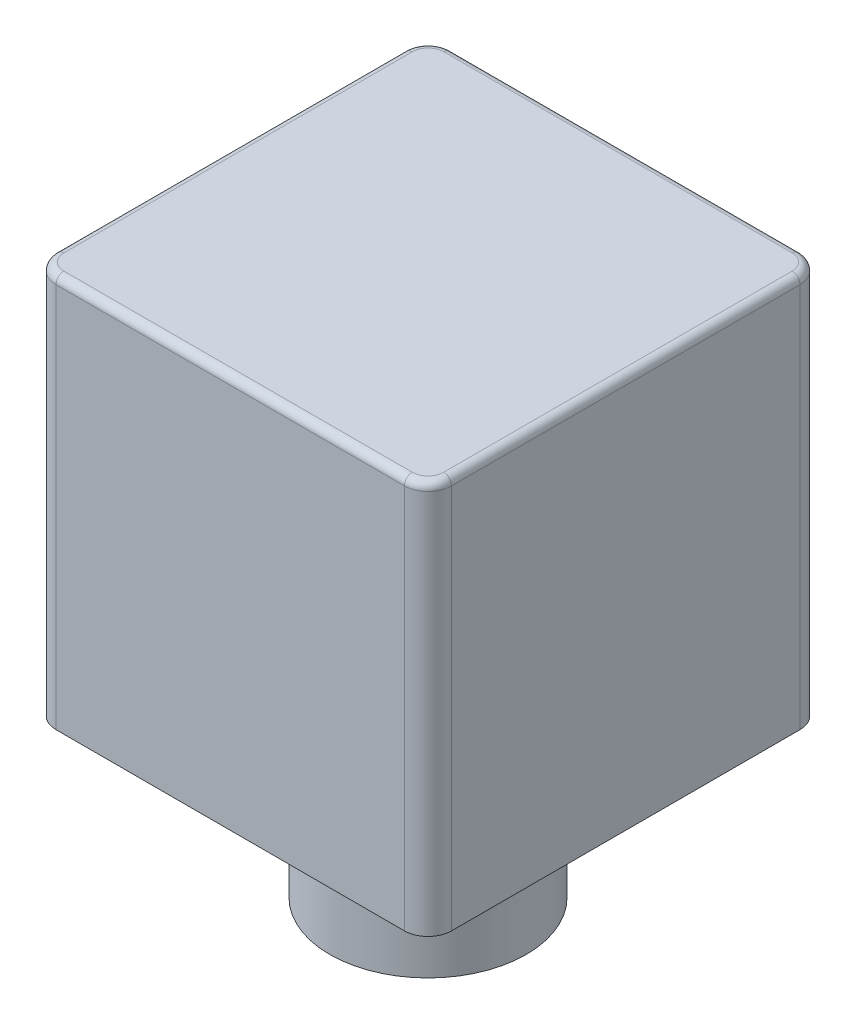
ISO-10303-21;
HEADER;
FILE_DESCRIPTION(('STEP AP214'),'2;1');
FILE_NAME('part.step','',(''),(''),'','','');
FILE_SCHEMA(('AUTOMOTIVE_DESIGN { 1 0 10303 214 1 1 1 1 }'));
ENDSEC;
DATA;
#1=APPLICATION_CONTEXT('core data for automotive mechanical design processes');
#2=APPLICATION_PROTOCOL_DEFINITION('international standard','automotive_design',2000,#1);
#3=PRODUCT_CONTEXT('',#1,'mechanical');
#4=PRODUCT('Part','Part','',(#3));
#5=PRODUCT_RELATED_PRODUCT_CATEGORY('part','',(#4));
#6=PRODUCT_DEFINITION_FORMATION('','',#4);
#7=PRODUCT_DEFINITION_CONTEXT('part definition',#1,'design');
#8=PRODUCT_DEFINITION('design','',#6,#7);
#9=PRODUCT_DEFINITION_SHAPE('','',#8);
#10=(LENGTH_UNIT() NAMED_UNIT(*) SI_UNIT(.MILLI.,.METRE.));
#11=(NAMED_UNIT(*) PLANE_ANGLE_UNIT() SI_UNIT($,.RADIAN.));
#12=(NAMED_UNIT(*) SI_UNIT($,.STERADIAN.) SOLID_ANGLE_UNIT());
#13=UNCERTAINTY_MEASURE_WITH_UNIT(LENGTH_MEASURE(1.E-05),#10,'distance_accuracy_value','');
#14=(GEOMETRIC_REPRESENTATION_CONTEXT(3) GLOBAL_UNCERTAINTY_ASSIGNED_CONTEXT((#13)) GLOBAL_UNIT_ASSIGNED_CONTEXT((#10,
#11,#12)) REPRESENTATION_CONTEXT('',''));
#15=CARTESIAN_POINT('',(0.,0.,0.));
#16=DIRECTION('',(0.,0.,1.));
#17=DIRECTION('',(1.,0.,0.));
#18=AXIS2_PLACEMENT_3D('',#15,#16,#17);
#19=CARTESIAN_POINT('',(0.,0.,0.));
#20=DIRECTION('',(0.,1.,0.));
#21=DIRECTION('',(0.,0.,1.));
#22=AXIS2_PLACEMENT_3D('',#19,#20,#21);
#23=PLANE('',#22);
#24=CARTESIAN_POINT('',(0.,0.,0.));
#25=DIRECTION('',(0.,1.,0.));
#26=DIRECTION('',(0.,0.,1.));
#27=AXIS2_PLACEMENT_3D('',#24,#25,#26);
#28=CIRCLE('',#27,12.5);
#29=CARTESIAN_POINT('',(0.,0.,12.5));
#30=VERTEX_POINT('',#29);
#31=EDGE_CURVE('E145',#30,#30,#28,.T.);
#32=ORIENTED_EDGE('',*,*,#31,.F.);
#33=EDGE_LOOP('',(#32));
#34=FACE_BOUND('',#33,.T.);
#35=CARTESIAN_POINT('',(0.,0.,0.));
#36=DIRECTION('',(0.,1.,0.));
#37=DIRECTION('',(0.,0.,1.));
#38=AXIS2_PLACEMENT_3D('',#35,#36,#37);
#39=CIRCLE('',#38,7.5);
#40=CARTESIAN_POINT('',(4.5,0.,-6.));
#41=VERTEX_POINT('',#40);
#42=CARTESIAN_POINT('',(4.5,0.,6.));
#43=VERTEX_POINT('',#42);
#44=EDGE_CURVE('E149',#41,#43,#39,.T.);
#45=ORIENTED_EDGE('',*,*,#44,.T.);
#46=DIRECTION('',(0.,0.,-1.));
#47=VECTOR('',#46,1.);
#48=CARTESIAN_POINT('',(4.5,0.,-6.));
#49=LINE('',#48,#47);
#50=EDGE_CURVE('E142',#43,#41,#49,.T.);
#51=ORIENTED_EDGE('',*,*,#50,.T.);
#52=EDGE_LOOP('',(#45,#51));
#53=FACE_BOUND('',#52,.T.);
#54=ADVANCED_FACE('F28',(#34,#53),#23,.F.);
#55=CARTESIAN_POINT('',(0.,20.,0.));
#56=DIRECTION('',(0.,-1.,0.));
#57=DIRECTION('',(0.,0.,-1.));
#58=AXIS2_PLACEMENT_3D('',#55,#56,#57);
#59=CYLINDRICAL_SURFACE('',#58,12.5);
#60=CARTESIAN_POINT('',(0.,17.,0.));
#61=DIRECTION('',(0.,-1.,0.));
#62=DIRECTION('',(0.,0.,-1.));
#63=AXIS2_PLACEMENT_3D('',#60,#61,#62);
#64=CIRCLE('',#63,12.5);
#65=CARTESIAN_POINT('',(0.,17.,-12.5));
#66=VERTEX_POINT('',#65);
#67=EDGE_CURVE('E185',#66,#66,#64,.T.);
#68=ORIENTED_EDGE('',*,*,#67,.T.);
#69=EDGE_LOOP('',(#68));
#70=FACE_BOUND('',#69,.T.);
#71=ORIENTED_EDGE('',*,*,#31,.T.);
#72=EDGE_LOOP('',(#71));
#73=FACE_BOUND('',#72,.T.);
#74=ADVANCED_FACE('F30',(#70,#73),#59,.T.);
#75=CARTESIAN_POINT('',(0.,20.,0.));
#76=DIRECTION('',(0.,-1.,0.));
#77=DIRECTION('',(0.,0.,-1.));
#78=AXIS2_PLACEMENT_3D('',#75,#76,#77);
#79=CYLINDRICAL_SURFACE('',#78,7.5);
#80=ORIENTED_EDGE('',*,*,#44,.F.);
#81=DIRECTION('',(0.,-1.,0.));
#82=VECTOR('',#81,1.);
#83=CARTESIAN_POINT('',(4.5,20.,-6.));
#84=LINE('',#83,#82);
#85=CARTESIAN_POINT('',(4.5,20.,-6.));
#86=VERTEX_POINT('',#85);
#87=EDGE_CURVE('E136',#86,#41,#84,.T.);
#88=ORIENTED_EDGE('',*,*,#87,.F.);
#89=CARTESIAN_POINT('',(0.,20.,0.));
#90=DIRECTION('',(0.,1.,0.));
#91=DIRECTION('',(0.,0.,1.));
#92=AXIS2_PLACEMENT_3D('',#89,#90,#91);
#93=CIRCLE('',#92,7.5);
#94=CARTESIAN_POINT('',(4.5,20.,6.));
#95=VERTEX_POINT('',#94);
#96=EDGE_CURVE('E132',#86,#95,#93,.T.);
#97=ORIENTED_EDGE('',*,*,#96,.T.);
#98=DIRECTION('',(0.,-1.,0.));
#99=VECTOR('',#98,1.);
#100=CARTESIAN_POINT('',(4.5,20.,6.));
#101=LINE('',#100,#99);
#102=EDGE_CURVE('E139',#95,#43,#101,.T.);
#103=ORIENTED_EDGE('',*,*,#102,.T.);
#104=EDGE_LOOP('',(#80,#88,#97,#103));
#105=FACE_BOUND('',#104,.T.);
#106=ADVANCED_FACE('F147',(#105),#79,.F.);
#107=CARTESIAN_POINT('',(4.5,20.,-6.));
#108=DIRECTION('',(-1.,0.,0.));
#109=DIRECTION('',(0.,0.,1.));
#110=AXIS2_PLACEMENT_3D('',#107,#108,#109);
#111=PLANE('',#110);
#112=ORIENTED_EDGE('',*,*,#50,.F.);
#113=ORIENTED_EDGE('',*,*,#102,.F.);
#114=DIRECTION('',(0.,0.,-1.));
#115=VECTOR('',#114,1.);
#116=CARTESIAN_POINT('',(4.5,20.,-6.));
#117=LINE('',#116,#115);
#118=EDGE_CURVE('E128',#95,#86,#117,.T.);
#119=ORIENTED_EDGE('',*,*,#118,.T.);
#120=ORIENTED_EDGE('',*,*,#87,.T.);
#121=EDGE_LOOP('',(#112,#113,#119,#120));
#122=FACE_BOUND('',#121,.T.);
#123=ADVANCED_FACE('F140',(#122),#111,.T.);
#124=CARTESIAN_POINT('',(25.1477992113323,20.,25.1477992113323));
#125=DIRECTION('',(0.,-1.,0.));
#126=DIRECTION('',(0.,0.,-1.));
#127=AXIS2_PLACEMENT_3D('',#124,#125,#126);
#128=PLANE('',#127);
#129=ORIENTED_EDGE('',*,*,#118,.F.);
#130=ORIENTED_EDGE('',*,*,#96,.F.);
#131=EDGE_LOOP('',(#129,#130));
#132=FACE_BOUND('',#131,.T.);
#133=ADVANCED_FACE('F130',(#132),#128,.T.);
#134=CARTESIAN_POINT('',(0.,20.,0.));
#135=DIRECTION('',(0.,-1.,0.));
#136=DIRECTION('',(0.,0.,-1.));
#137=AXIS2_PLACEMENT_3D('',#134,#135,#136);
#138=CIRCLE('',#137,15.5);
#139=CARTESIAN_POINT('',(0.,20.,-15.5));
#140=VERTEX_POINT('',#139);
#141=EDGE_CURVE('E160',#140,#140,#138,.F.);
#142=ORIENTED_EDGE('',*,*,#141,.T.);
#143=EDGE_LOOP('',(#142));
#144=FACE_BOUND('',#143,.T.);
#145=DIRECTION('',(1.,0.,0.));
#146=VECTOR('',#145,1.);
#147=CARTESIAN_POINT('',(25.1477992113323,20.,25.1477992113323));
#148=LINE('',#147,#146);
#149=CARTESIAN_POINT('',(-22.1477992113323,20.,25.1477992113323));
#150=VERTEX_POINT('',#149);
#151=CARTESIAN_POINT('',(22.1477992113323,20.,25.1477992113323));
#152=VERTEX_POINT('',#151);
#153=EDGE_CURVE('E229',#150,#152,#148,.T.);
#154=ORIENTED_EDGE('',*,*,#153,.F.);
#155=CARTESIAN_POINT('',(-22.1477992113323,20.,22.1477992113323));
#156=DIRECTION('',(0.,-1.,0.));
#157=DIRECTION('',(0.,0.,-1.));
#158=AXIS2_PLACEMENT_3D('',#155,#156,#157);
#159=CIRCLE('',#158,3.);
#160=CARTESIAN_POINT('',(-25.1477992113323,20.,22.1477992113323));
#161=VERTEX_POINT('',#160);
#162=EDGE_CURVE('E169',#150,#161,#159,.T.);
#163=ORIENTED_EDGE('',*,*,#162,.T.);
#164=DIRECTION('',(0.,0.,1.));
#165=VECTOR('',#164,1.);
#166=CARTESIAN_POINT('',(-25.1477992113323,20.,-25.1477992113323));
#167=LINE('',#166,#165);
#168=CARTESIAN_POINT('',(-25.1477992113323,20.,-22.1477992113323));
#169=VERTEX_POINT('',#168);
#170=EDGE_CURVE('E307',#169,#161,#167,.T.);
#171=ORIENTED_EDGE('',*,*,#170,.F.);
#172=CARTESIAN_POINT('',(-22.1477992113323,20.,-22.1477992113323));
#173=DIRECTION('',(0.,-1.,0.));
#174=DIRECTION('',(0.,0.,-1.));
#175=AXIS2_PLACEMENT_3D('',#172,#173,#174);
#176=CIRCLE('',#175,3.);
#177=CARTESIAN_POINT('',(-22.1477992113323,20.,-25.1477992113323));
#178=VERTEX_POINT('',#177);
#179=EDGE_CURVE('E167',#169,#178,#176,.T.);
#180=ORIENTED_EDGE('',*,*,#179,.T.);
#181=DIRECTION('',(-1.,0.,0.));
#182=VECTOR('',#181,1.);
#183=CARTESIAN_POINT('',(25.1477992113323,20.,-25.1477992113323));
#184=LINE('',#183,#182);
#185=CARTESIAN_POINT('',(22.1477992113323,20.,-25.1477992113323));
#186=VERTEX_POINT('',#185);
#187=EDGE_CURVE('E305',#186,#178,#184,.T.);
#188=ORIENTED_EDGE('',*,*,#187,.F.);
#189=CARTESIAN_POINT('',(22.1477992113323,20.,-22.1477992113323));
#190=DIRECTION('',(0.,-1.,0.));
#191=DIRECTION('',(0.,0.,-1.));
#192=AXIS2_PLACEMENT_3D('',#189,#190,#191);
#193=CIRCLE('',#192,3.);
#194=CARTESIAN_POINT('',(25.1477992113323,20.,-22.1477992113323));
#195=VERTEX_POINT('',#194);
#196=EDGE_CURVE('E163',#186,#195,#193,.T.);
#197=ORIENTED_EDGE('',*,*,#196,.T.);
#198=DIRECTION('',(0.,0.,-1.));
#199=VECTOR('',#198,1.);
#200=CARTESIAN_POINT('',(25.1477992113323,20.,-25.1477992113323));
#201=LINE('',#200,#199);
#202=CARTESIAN_POINT('',(25.1477992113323,20.,22.1477992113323));
#203=VERTEX_POINT('',#202);
#204=EDGE_CURVE('E302',#203,#195,#201,.T.);
#205=ORIENTED_EDGE('',*,*,#204,.F.);
#206=CARTESIAN_POINT('',(22.1477992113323,20.,22.1477992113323));
#207=DIRECTION('',(0.,-1.,0.));
#208=DIRECTION('',(0.,0.,-1.));
#209=AXIS2_PLACEMENT_3D('',#206,#207,#208);
#210=CIRCLE('',#209,3.);
#211=EDGE_CURVE('E165',#203,#152,#210,.T.);
#212=ORIENTED_EDGE('',*,*,#211,.T.);
#213=EDGE_LOOP('',(#154,#163,#171,#180,#188,#197,#205,#212));
#214=FACE_BOUND('',#213,.T.);
#215=ADVANCED_FACE('F325',(#144,#214),#128,.T.);
#216=CARTESIAN_POINT('',(25.1477992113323,70.,-25.1477992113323));
#217=DIRECTION('',(-1.,0.,0.));
#218=DIRECTION('',(0.,0.,1.));
#219=AXIS2_PLACEMENT_3D('',#216,#217,#218);
#220=PLANE('',#219);
#221=DIRECTION('',(0.,-1.,0.));
#222=VECTOR('',#221,1.);
#223=CARTESIAN_POINT('',(25.1477992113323,70.,-22.1477992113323));
#224=LINE('',#223,#222);
#225=CARTESIAN_POINT('',(25.1477992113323,69.,-22.1477992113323));
#226=VERTEX_POINT('',#225);
#227=EDGE_CURVE('E180',#195,#226,#224,.F.);
#228=ORIENTED_EDGE('',*,*,#227,.T.);
#229=DIRECTION('',(0.,0.,-1.));
#230=VECTOR('',#229,1.);
#231=CARTESIAN_POINT('',(25.1477992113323,69.,-25.1477992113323));
#232=LINE('',#231,#230);
#233=CARTESIAN_POINT('',(25.1477992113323,69.,22.1477992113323));
#234=VERTEX_POINT('',#233);
#235=EDGE_CURVE('E212',#226,#234,#232,.F.);
#236=ORIENTED_EDGE('',*,*,#235,.T.);
#237=DIRECTION('',(0.,-1.,0.));
#238=VECTOR('',#237,1.);
#239=CARTESIAN_POINT('',(25.1477992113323,70.,22.1477992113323));
#240=LINE('',#239,#238);
#241=EDGE_CURVE('E183',#234,#203,#240,.T.);
#242=ORIENTED_EDGE('',*,*,#241,.T.);
#243=ORIENTED_EDGE('',*,*,#204,.T.);
#244=EDGE_LOOP('',(#228,#236,#242,#243));
#245=FACE_BOUND('',#244,.T.);
#246=ADVANCED_FACE('F322',(#245),#220,.F.);
#247=CARTESIAN_POINT('',(25.1477992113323,70.,-25.1477992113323));
#248=DIRECTION('',(0.,0.,1.));
#249=DIRECTION('',(1.,0.,0.));
#250=AXIS2_PLACEMENT_3D('',#247,#248,#249);
#251=PLANE('',#250);
#252=DIRECTION('',(0.,-1.,0.));
#253=VECTOR('',#252,1.);
#254=CARTESIAN_POINT('',(-22.1477992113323,70.,-25.1477992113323));
#255=LINE('',#254,#253);
#256=CARTESIAN_POINT('',(-22.1477992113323,69.,-25.1477992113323));
#257=VERTEX_POINT('',#256);
#258=EDGE_CURVE('E177',#178,#257,#255,.F.);
#259=ORIENTED_EDGE('',*,*,#258,.T.);
#260=DIRECTION('',(-1.,0.,0.));
#261=VECTOR('',#260,1.);
#262=CARTESIAN_POINT('',(25.1477992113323,69.,-25.1477992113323));
#263=LINE('',#262,#261);
#264=CARTESIAN_POINT('',(22.1477992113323,69.,-25.1477992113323));
#265=VERTEX_POINT('',#264);
#266=EDGE_CURVE('E208',#257,#265,#263,.F.);
#267=ORIENTED_EDGE('',*,*,#266,.T.);
#268=DIRECTION('',(0.,-1.,0.));
#269=VECTOR('',#268,1.);
#270=CARTESIAN_POINT('',(22.1477992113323,70.,-25.1477992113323));
#271=LINE('',#270,#269);
#272=EDGE_CURVE('E175',#265,#186,#271,.T.);
#273=ORIENTED_EDGE('',*,*,#272,.T.);
#274=ORIENTED_EDGE('',*,*,#187,.T.);
#275=EDGE_LOOP('',(#259,#267,#273,#274));
#276=FACE_BOUND('',#275,.T.);
#277=ADVANCED_FACE('F282',(#276),#251,.F.);
#278=CARTESIAN_POINT('',(-25.1477992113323,70.,-25.1477992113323));
#279=DIRECTION('',(1.,0.,0.));
#280=DIRECTION('',(0.,0.,-1.));
#281=AXIS2_PLACEMENT_3D('',#278,#279,#280);
#282=PLANE('',#281);
#283=DIRECTION('',(0.,-1.,0.));
#284=VECTOR('',#283,1.);
#285=CARTESIAN_POINT('',(-25.1477992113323,70.,22.1477992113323));
#286=LINE('',#285,#284);
#287=CARTESIAN_POINT('',(-25.1477992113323,69.,22.1477992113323));
#288=VERTEX_POINT('',#287);
#289=EDGE_CURVE('E173',#161,#288,#286,.F.);
#290=ORIENTED_EDGE('',*,*,#289,.T.);
#291=DIRECTION('',(0.,0.,1.));
#292=VECTOR('',#291,1.);
#293=CARTESIAN_POINT('',(-25.1477992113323,69.,-25.1477992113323));
#294=LINE('',#293,#292);
#295=CARTESIAN_POINT('',(-25.1477992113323,69.,-22.1477992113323));
#296=VERTEX_POINT('',#295);
#297=EDGE_CURVE('E11',#288,#296,#294,.F.);
#298=ORIENTED_EDGE('',*,*,#297,.T.);
#299=DIRECTION('',(0.,-1.,0.));
#300=VECTOR('',#299,1.);
#301=CARTESIAN_POINT('',(-25.1477992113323,70.,-22.1477992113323));
#302=LINE('',#301,#300);
#303=EDGE_CURVE('E171',#296,#169,#302,.T.);
#304=ORIENTED_EDGE('',*,*,#303,.T.);
#305=ORIENTED_EDGE('',*,*,#170,.T.);
#306=EDGE_LOOP('',(#290,#298,#304,#305));
#307=FACE_BOUND('',#306,.T.);
#308=ADVANCED_FACE('F261',(#307),#282,.F.);
#309=CARTESIAN_POINT('',(25.1477992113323,70.,25.1477992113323));
#310=DIRECTION('',(0.,0.,-1.));
#311=DIRECTION('',(-1.,0.,0.));
#312=AXIS2_PLACEMENT_3D('',#309,#310,#311);
#313=PLANE('',#312);
#314=DIRECTION('',(0.,-1.,0.));
#315=VECTOR('',#314,1.);
#316=CARTESIAN_POINT('',(22.1477992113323,70.,25.1477992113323));
#317=LINE('',#316,#315);
#318=CARTESIAN_POINT('',(22.1477992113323,69.,25.1477992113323));
#319=VERTEX_POINT('',#318);
#320=EDGE_CURVE('E156',#152,#319,#317,.F.);
#321=ORIENTED_EDGE('',*,*,#320,.T.);
#322=DIRECTION('',(1.,0.,0.));
#323=VECTOR('',#322,1.);
#324=CARTESIAN_POINT('',(25.1477992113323,69.,25.1477992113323));
#325=LINE('',#324,#323);
#326=CARTESIAN_POINT('',(-22.1477992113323,69.,25.1477992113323));
#327=VERTEX_POINT('',#326);
#328=EDGE_CURVE('E50',#319,#327,#325,.F.);
#329=ORIENTED_EDGE('',*,*,#328,.T.);
#330=DIRECTION('',(0.,-1.,0.));
#331=VECTOR('',#330,1.);
#332=CARTESIAN_POINT('',(-22.1477992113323,70.,25.1477992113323));
#333=LINE('',#332,#331);
#334=EDGE_CURVE('E158',#327,#150,#333,.T.);
#335=ORIENTED_EDGE('',*,*,#334,.T.);
#336=ORIENTED_EDGE('',*,*,#153,.T.);
#337=EDGE_LOOP('',(#321,#329,#335,#336));
#338=FACE_BOUND('',#337,.T.);
#339=ADVANCED_FACE('F227',(#338),#313,.F.);
#340=CARTESIAN_POINT('',(25.1477992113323,70.,25.1477992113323));
#341=DIRECTION('',(0.,-1.,0.));
#342=DIRECTION('',(0.,0.,-1.));
#343=AXIS2_PLACEMENT_3D('',#340,#341,#342);
#344=PLANE('',#343);
#345=DIRECTION('',(-1.,0.,0.));
#346=VECTOR('',#345,1.);
#347=CARTESIAN_POINT('',(25.1477992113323,70.,-24.1477992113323));
#348=LINE('',#347,#346);
#349=CARTESIAN_POINT('',(22.1477992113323,70.,-24.1477992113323));
#350=VERTEX_POINT('',#349);
#351=CARTESIAN_POINT('',(-22.1477992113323,70.,-24.1477992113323));
#352=VERTEX_POINT('',#351);
#353=EDGE_CURVE('E200',#350,#352,#348,.T.);
#354=ORIENTED_EDGE('',*,*,#353,.T.);
#355=CARTESIAN_POINT('',(-22.1477992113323,70.,-22.1477992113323));
#356=DIRECTION('',(0.,-1.,0.));
#357=DIRECTION('',(0.,0.,-1.));
#358=AXIS2_PLACEMENT_3D('',#355,#356,#357);
#359=CIRCLE('',#358,2.);
#360=CARTESIAN_POINT('',(-24.1477992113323,70.,-22.1477992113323));
#361=VERTEX_POINT('',#360);
#362=EDGE_CURVE('E202',#352,#361,#359,.F.);
#363=ORIENTED_EDGE('',*,*,#362,.T.);
#364=DIRECTION('',(0.,0.,1.));
#365=VECTOR('',#364,1.);
#366=CARTESIAN_POINT('',(-24.1477992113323,70.,25.1477992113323));
#367=LINE('',#366,#365);
#368=CARTESIAN_POINT('',(-24.1477992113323,70.,22.1477992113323));
#369=VERTEX_POINT('',#368);
#370=EDGE_CURVE('E188',#361,#369,#367,.T.);
#371=ORIENTED_EDGE('',*,*,#370,.T.);
#372=CARTESIAN_POINT('',(-22.1477992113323,70.,22.1477992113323));
#373=DIRECTION('',(0.,-1.,0.));
#374=DIRECTION('',(0.,0.,-1.));
#375=AXIS2_PLACEMENT_3D('',#372,#373,#374);
#376=CIRCLE('',#375,2.);
#377=CARTESIAN_POINT('',(-22.1477992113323,70.,24.1477992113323));
#378=VERTEX_POINT('',#377);
#379=EDGE_CURVE('E190',#369,#378,#376,.F.);
#380=ORIENTED_EDGE('',*,*,#379,.T.);
#381=DIRECTION('',(1.,0.,0.));
#382=VECTOR('',#381,1.);
#383=CARTESIAN_POINT('',(25.1477992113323,70.,24.1477992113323));
#384=LINE('',#383,#382);
#385=CARTESIAN_POINT('',(22.1477992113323,70.,24.1477992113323));
#386=VERTEX_POINT('',#385);
#387=EDGE_CURVE('E192',#378,#386,#384,.T.);
#388=ORIENTED_EDGE('',*,*,#387,.T.);
#389=CARTESIAN_POINT('',(22.1477992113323,70.,22.1477992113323));
#390=DIRECTION('',(0.,-1.,0.));
#391=DIRECTION('',(0.,0.,-1.));
#392=AXIS2_PLACEMENT_3D('',#389,#390,#391);
#393=CIRCLE('',#392,2.);
#394=CARTESIAN_POINT('',(24.1477992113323,70.,22.1477992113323));
#395=VERTEX_POINT('',#394);
#396=EDGE_CURVE('E194',#386,#395,#393,.F.);
#397=ORIENTED_EDGE('',*,*,#396,.T.);
#398=DIRECTION('',(0.,0.,-1.));
#399=VECTOR('',#398,1.);
#400=CARTESIAN_POINT('',(24.1477992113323,70.,25.1477992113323));
#401=LINE('',#400,#399);
#402=CARTESIAN_POINT('',(24.1477992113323,70.,-22.1477992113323));
#403=VERTEX_POINT('',#402);
#404=EDGE_CURVE('E196',#395,#403,#401,.T.);
#405=ORIENTED_EDGE('',*,*,#404,.T.);
#406=CARTESIAN_POINT('',(22.1477992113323,70.,-22.1477992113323));
#407=DIRECTION('',(0.,-1.,0.));
#408=DIRECTION('',(0.,0.,-1.));
#409=AXIS2_PLACEMENT_3D('',#406,#407,#408);
#410=CIRCLE('',#409,2.);
#411=EDGE_CURVE('E198',#403,#350,#410,.F.);
#412=ORIENTED_EDGE('',*,*,#411,.T.);
#413=EDGE_LOOP('',(#354,#363,#371,#380,#388,#397,#405,#412));
#414=FACE_BOUND('',#413,.T.);
#415=ADVANCED_FACE('F333',(#414),#344,.F.);
#416=CARTESIAN_POINT('',(-22.1477992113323,70.,22.1477992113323));
#417=DIRECTION('',(0.,-1.,0.));
#418=DIRECTION('',(0.,0.,-1.));
#419=AXIS2_PLACEMENT_3D('',#416,#417,#418);
#420=CYLINDRICAL_SURFACE('',#419,3.);
#421=ORIENTED_EDGE('',*,*,#334,.F.);
#422=CARTESIAN_POINT('',(-22.1477992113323,69.,22.1477992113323));
#423=DIRECTION('',(0.,-1.,0.));
#424=DIRECTION('',(0.,0.,-1.));
#425=AXIS2_PLACEMENT_3D('',#422,#423,#424);
#426=CIRCLE('',#425,3.);
#427=EDGE_CURVE('E36',#327,#288,#426,.T.);
#428=ORIENTED_EDGE('',*,*,#427,.T.);
#429=ORIENTED_EDGE('',*,*,#289,.F.);
#430=ORIENTED_EDGE('',*,*,#162,.F.);
#431=EDGE_LOOP('',(#421,#428,#429,#430));
#432=FACE_BOUND('',#431,.T.);
#433=ADVANCED_FACE('F336',(#432),#420,.T.);
#434=CARTESIAN_POINT('',(-22.1477992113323,70.,-22.1477992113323));
#435=DIRECTION('',(0.,-1.,0.));
#436=DIRECTION('',(0.,0.,-1.));
#437=AXIS2_PLACEMENT_3D('',#434,#435,#436);
#438=CYLINDRICAL_SURFACE('',#437,3.);
#439=ORIENTED_EDGE('',*,*,#303,.F.);
#440=CARTESIAN_POINT('',(-22.1477992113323,69.,-22.1477992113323));
#441=DIRECTION('',(0.,-1.,0.));
#442=DIRECTION('',(0.,0.,-1.));
#443=AXIS2_PLACEMENT_3D('',#440,#441,#442);
#444=CIRCLE('',#443,3.);
#445=EDGE_CURVE('E205',#296,#257,#444,.T.);
#446=ORIENTED_EDGE('',*,*,#445,.T.);
#447=ORIENTED_EDGE('',*,*,#258,.F.);
#448=ORIENTED_EDGE('',*,*,#179,.F.);
#449=EDGE_LOOP('',(#439,#446,#447,#448));
#450=FACE_BOUND('',#449,.T.);
#451=ADVANCED_FACE('F266',(#450),#438,.T.);
#452=CARTESIAN_POINT('',(22.1477992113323,70.,22.1477992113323));
#453=DIRECTION('',(0.,-1.,0.));
#454=DIRECTION('',(0.,0.,-1.));
#455=AXIS2_PLACEMENT_3D('',#452,#453,#454);
#456=CYLINDRICAL_SURFACE('',#455,3.);
#457=ORIENTED_EDGE('',*,*,#241,.F.);
#458=CARTESIAN_POINT('',(22.1477992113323,69.,22.1477992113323));
#459=DIRECTION('',(0.,-1.,0.));
#460=DIRECTION('',(0.,0.,-1.));
#461=AXIS2_PLACEMENT_3D('',#458,#459,#460);
#462=CIRCLE('',#461,3.);
#463=EDGE_CURVE('E214',#234,#319,#462,.T.);
#464=ORIENTED_EDGE('',*,*,#463,.T.);
#465=ORIENTED_EDGE('',*,*,#320,.F.);
#466=ORIENTED_EDGE('',*,*,#211,.F.);
#467=EDGE_LOOP('',(#457,#464,#465,#466));
#468=FACE_BOUND('',#467,.T.);
#469=ADVANCED_FACE('F220',(#468),#456,.T.);
#470=CARTESIAN_POINT('',(22.1477992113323,70.,-22.1477992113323));
#471=DIRECTION('',(0.,-1.,0.));
#472=DIRECTION('',(0.,0.,-1.));
#473=AXIS2_PLACEMENT_3D('',#470,#471,#472);
#474=CYLINDRICAL_SURFACE('',#473,3.);
#475=ORIENTED_EDGE('',*,*,#272,.F.);
#476=CARTESIAN_POINT('',(22.1477992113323,69.,-22.1477992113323));
#477=DIRECTION('',(0.,-1.,0.));
#478=DIRECTION('',(0.,0.,-1.));
#479=AXIS2_PLACEMENT_3D('',#476,#477,#478);
#480=CIRCLE('',#479,3.);
#481=EDGE_CURVE('E210',#265,#226,#480,.T.);
#482=ORIENTED_EDGE('',*,*,#481,.T.);
#483=ORIENTED_EDGE('',*,*,#227,.F.);
#484=ORIENTED_EDGE('',*,*,#196,.F.);
#485=EDGE_LOOP('',(#475,#482,#483,#484));
#486=FACE_BOUND('',#485,.T.);
#487=ADVANCED_FACE('F287',(#486),#474,.T.);
#488=CARTESIAN_POINT('',(0.,17.,0.));
#489=DIRECTION('',(0.,-1.,0.));
#490=DIRECTION('',(0.,0.,-1.));
#491=AXIS2_PLACEMENT_3D('',#488,#489,#490);
#492=TOROIDAL_SURFACE('',#491,15.5,3.);
#493=ORIENTED_EDGE('',*,*,#67,.F.);
#494=EDGE_LOOP('',(#493));
#495=FACE_BOUND('',#494,.T.);
#496=ORIENTED_EDGE('',*,*,#141,.F.);
#497=EDGE_LOOP('',(#496));
#498=FACE_BOUND('',#497,.T.);
#499=ADVANCED_FACE('F348',(#495,#498),#492,.F.);
#500=CARTESIAN_POINT('',(22.1477992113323,69.,22.1477992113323));
#501=DIRECTION('',(0.,-1.,0.));
#502=DIRECTION('',(0.,0.,-1.));
#503=AXIS2_PLACEMENT_3D('',#500,#501,#502);
#504=TOROIDAL_SURFACE('',#503,2.,1.);
#505=CARTESIAN_POINT('',(22.1477992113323,69.,24.1477992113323));
#506=DIRECTION('',(-1.,0.,0.));
#507=DIRECTION('',(0.,0.,1.));
#508=AXIS2_PLACEMENT_3D('',#505,#506,#507);
#509=CIRCLE('',#508,1.);
#510=EDGE_CURVE('E232',#319,#386,#509,.T.);
#511=ORIENTED_EDGE('',*,*,#510,.F.);
#512=ORIENTED_EDGE('',*,*,#463,.F.);
#513=CARTESIAN_POINT('',(24.1477992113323,69.,22.1477992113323));
#514=DIRECTION('',(0.,0.,-1.));
#515=DIRECTION('',(-1.,0.,0.));
#516=AXIS2_PLACEMENT_3D('',#513,#514,#515);
#517=CIRCLE('',#516,1.);
#518=EDGE_CURVE('E236',#395,#234,#517,.T.);
#519=ORIENTED_EDGE('',*,*,#518,.F.);
#520=ORIENTED_EDGE('',*,*,#396,.F.);
#521=EDGE_LOOP('',(#511,#512,#519,#520));
#522=FACE_BOUND('',#521,.T.);
#523=ADVANCED_FACE('F233',(#522),#504,.T.);
#524=CARTESIAN_POINT('',(24.1477992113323,69.,25.1477992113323));
#525=DIRECTION('',(0.,0.,-1.));
#526=DIRECTION('',(-1.,0.,0.));
#527=AXIS2_PLACEMENT_3D('',#524,#525,#526);
#528=CYLINDRICAL_SURFACE('',#527,1.);
#529=ORIENTED_EDGE('',*,*,#518,.T.);
#530=ORIENTED_EDGE('',*,*,#235,.F.);
#531=CARTESIAN_POINT('',(24.1477992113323,69.,-22.1477992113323));
#532=DIRECTION('',(0.,0.,-1.));
#533=DIRECTION('',(-1.,0.,0.));
#534=AXIS2_PLACEMENT_3D('',#531,#532,#533);
#535=CIRCLE('',#534,1.);
#536=EDGE_CURVE('E237',#403,#226,#535,.T.);
#537=ORIENTED_EDGE('',*,*,#536,.F.);
#538=ORIENTED_EDGE('',*,*,#404,.F.);
#539=EDGE_LOOP('',(#529,#530,#537,#538));
#540=FACE_BOUND('',#539,.T.);
#541=ADVANCED_FACE('F354',(#540),#528,.T.);
#542=CARTESIAN_POINT('',(25.1477992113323,69.,24.1477992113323));
#543=DIRECTION('',(1.,0.,0.));
#544=DIRECTION('',(0.,0.,-1.));
#545=AXIS2_PLACEMENT_3D('',#542,#543,#544);
#546=CYLINDRICAL_SURFACE('',#545,1.);
#547=ORIENTED_EDGE('',*,*,#510,.T.);
#548=ORIENTED_EDGE('',*,*,#387,.F.);
#549=CARTESIAN_POINT('',(-22.1477992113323,69.,24.1477992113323));
#550=DIRECTION('',(-1.,0.,0.));
#551=DIRECTION('',(0.,0.,1.));
#552=AXIS2_PLACEMENT_3D('',#549,#550,#551);
#553=CIRCLE('',#552,1.);
#554=EDGE_CURVE('E242',#327,#378,#553,.T.);
#555=ORIENTED_EDGE('',*,*,#554,.F.);
#556=ORIENTED_EDGE('',*,*,#328,.F.);
#557=EDGE_LOOP('',(#547,#548,#555,#556));
#558=FACE_BOUND('',#557,.T.);
#559=ADVANCED_FACE('F240',(#558),#546,.T.);
#560=CARTESIAN_POINT('',(22.1477992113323,69.,-22.1477992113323));
#561=DIRECTION('',(0.,-1.,0.));
#562=DIRECTION('',(0.,0.,-1.));
#563=AXIS2_PLACEMENT_3D('',#560,#561,#562);
#564=TOROIDAL_SURFACE('',#563,2.,1.);
#565=ORIENTED_EDGE('',*,*,#536,.T.);
#566=ORIENTED_EDGE('',*,*,#481,.F.);
#567=CARTESIAN_POINT('',(22.1477992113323,69.,-24.1477992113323));
#568=DIRECTION('',(-1.,0.,0.));
#569=DIRECTION('',(0.,0.,1.));
#570=AXIS2_PLACEMENT_3D('',#567,#568,#569);
#571=CIRCLE('',#570,1.);
#572=EDGE_CURVE('E245',#350,#265,#571,.T.);
#573=ORIENTED_EDGE('',*,*,#572,.F.);
#574=ORIENTED_EDGE('',*,*,#411,.F.);
#575=EDGE_LOOP('',(#565,#566,#573,#574));
#576=FACE_BOUND('',#575,.T.);
#577=ADVANCED_FACE('F292',(#576),#564,.T.);
#578=CARTESIAN_POINT('',(-22.1477992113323,69.,22.1477992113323));
#579=DIRECTION('',(0.,-1.,0.));
#580=DIRECTION('',(0.,0.,-1.));
#581=AXIS2_PLACEMENT_3D('',#578,#579,#580);
#582=TOROIDAL_SURFACE('',#581,2.,1.);
#583=ORIENTED_EDGE('',*,*,#554,.T.);
#584=ORIENTED_EDGE('',*,*,#379,.F.);
#585=CARTESIAN_POINT('',(-24.1477992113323,69.,22.1477992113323));
#586=DIRECTION('',(0.,0.,-1.));
#587=DIRECTION('',(-1.,0.,0.));
#588=AXIS2_PLACEMENT_3D('',#585,#586,#587);
#589=CIRCLE('',#588,1.);
#590=EDGE_CURVE('E250',#288,#369,#589,.T.);
#591=ORIENTED_EDGE('',*,*,#590,.F.);
#592=ORIENTED_EDGE('',*,*,#427,.F.);
#593=EDGE_LOOP('',(#583,#584,#591,#592));
#594=FACE_BOUND('',#593,.T.);
#595=ADVANCED_FACE('F248',(#594),#582,.T.);
#596=CARTESIAN_POINT('',(25.1477992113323,69.,-24.1477992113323));
#597=DIRECTION('',(-1.,0.,0.));
#598=DIRECTION('',(0.,0.,1.));
#599=AXIS2_PLACEMENT_3D('',#596,#597,#598);
#600=CYLINDRICAL_SURFACE('',#599,1.);
#601=ORIENTED_EDGE('',*,*,#572,.T.);
#602=ORIENTED_EDGE('',*,*,#266,.F.);
#603=CARTESIAN_POINT('',(-22.1477992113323,69.,-24.1477992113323));
#604=DIRECTION('',(-1.,0.,0.));
#605=DIRECTION('',(0.,0.,1.));
#606=AXIS2_PLACEMENT_3D('',#603,#604,#605);
#607=CIRCLE('',#606,1.);
#608=EDGE_CURVE('E254',#352,#257,#607,.T.);
#609=ORIENTED_EDGE('',*,*,#608,.F.);
#610=ORIENTED_EDGE('',*,*,#353,.F.);
#611=EDGE_LOOP('',(#601,#602,#609,#610));
#612=FACE_BOUND('',#611,.T.);
#613=ADVANCED_FACE('F278',(#612),#600,.T.);
#614=CARTESIAN_POINT('',(-24.1477992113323,69.,25.1477992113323));
#615=DIRECTION('',(0.,0.,1.));
#616=DIRECTION('',(1.,0.,0.));
#617=AXIS2_PLACEMENT_3D('',#614,#615,#616);
#618=CYLINDRICAL_SURFACE('',#617,1.);
#619=ORIENTED_EDGE('',*,*,#590,.T.);
#620=ORIENTED_EDGE('',*,*,#370,.F.);
#621=CARTESIAN_POINT('',(-24.1477992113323,69.,-22.1477992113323));
#622=DIRECTION('',(0.,0.,-1.));
#623=DIRECTION('',(-1.,0.,0.));
#624=AXIS2_PLACEMENT_3D('',#621,#622,#623);
#625=CIRCLE('',#624,1.);
#626=EDGE_CURVE('E258',#296,#361,#625,.T.);
#627=ORIENTED_EDGE('',*,*,#626,.F.);
#628=ORIENTED_EDGE('',*,*,#297,.F.);
#629=EDGE_LOOP('',(#619,#620,#627,#628));
#630=FACE_BOUND('',#629,.T.);
#631=ADVANCED_FACE('F257',(#630),#618,.T.);
#632=CARTESIAN_POINT('',(-22.1477992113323,69.,-22.1477992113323));
#633=DIRECTION('',(0.,-1.,0.));
#634=DIRECTION('',(0.,0.,-1.));
#635=AXIS2_PLACEMENT_3D('',#632,#633,#634);
#636=TOROIDAL_SURFACE('',#635,2.,1.);
#637=ORIENTED_EDGE('',*,*,#608,.T.);
#638=ORIENTED_EDGE('',*,*,#445,.F.);
#639=ORIENTED_EDGE('',*,*,#626,.T.);
#640=ORIENTED_EDGE('',*,*,#362,.F.);
#641=EDGE_LOOP('',(#637,#638,#639,#640));
#642=FACE_BOUND('',#641,.T.);
#643=ADVANCED_FACE('F270',(#642),#636,.T.);
#644=CLOSED_SHELL('',(#54,#74,#106,#123,#133,#215,#246,#277,#308,#339,#415,#433,#451,#469,#487,
#499,#523,#541,#559,#577,#595,#613,#631,#643));
#645=MANIFOLD_SOLID_BREP('B2',#644);
#646=ADVANCED_BREP_SHAPE_REPRESENTATION('',(#18,#645),#14);
#647=SHAPE_DEFINITION_REPRESENTATION(#9,#646);
ENDSEC;
END-ISO-10303-21;
